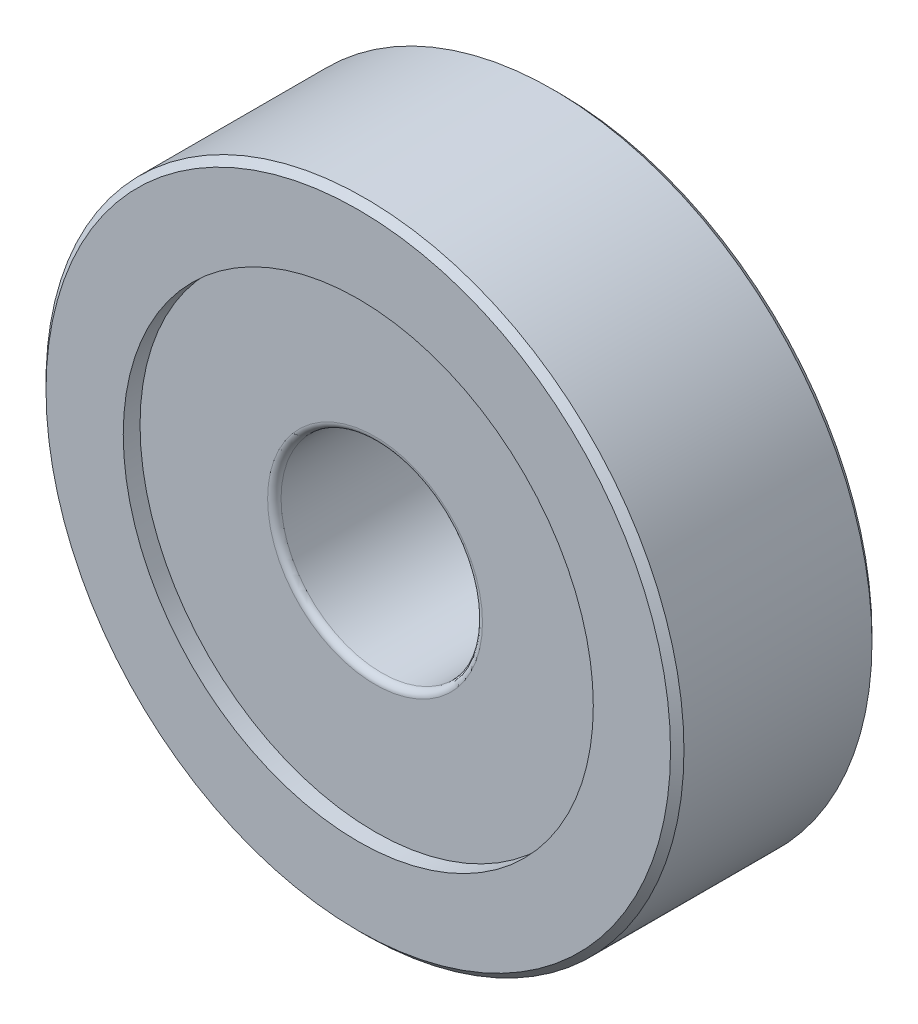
ISO-10303-21;
HEADER;
FILE_DESCRIPTION(('STEP AP214'),'2;1');
FILE_NAME('part.step','',(''),(''),'','','');
FILE_SCHEMA(('AUTOMOTIVE_DESIGN { 1 0 10303 214 1 1 1 1 }'));
ENDSEC;
DATA;
#1=APPLICATION_CONTEXT('core data for automotive mechanical design processes');
#2=APPLICATION_PROTOCOL_DEFINITION('international standard','automotive_design',2000,#1);
#3=PRODUCT_CONTEXT('',#1,'mechanical');
#4=PRODUCT('Part','Part','',(#3));
#5=PRODUCT_RELATED_PRODUCT_CATEGORY('part','',(#4));
#6=PRODUCT_DEFINITION_FORMATION('','',#4);
#7=PRODUCT_DEFINITION_CONTEXT('part definition',#1,'design');
#8=PRODUCT_DEFINITION('design','',#6,#7);
#9=PRODUCT_DEFINITION_SHAPE('','',#8);
#10=(LENGTH_UNIT() NAMED_UNIT(*) SI_UNIT(.MILLI.,.METRE.));
#11=(NAMED_UNIT(*) PLANE_ANGLE_UNIT() SI_UNIT($,.RADIAN.));
#12=(NAMED_UNIT(*) SI_UNIT($,.STERADIAN.) SOLID_ANGLE_UNIT());
#13=UNCERTAINTY_MEASURE_WITH_UNIT(LENGTH_MEASURE(1.E-05),#10,'distance_accuracy_value','');
#14=(GEOMETRIC_REPRESENTATION_CONTEXT(3) GLOBAL_UNCERTAINTY_ASSIGNED_CONTEXT((#13)) GLOBAL_UNIT_ASSIGNED_CONTEXT((#10,
#11,#12)) REPRESENTATION_CONTEXT('',''));
#15=CARTESIAN_POINT('',(0.,0.,0.));
#16=DIRECTION('',(0.,0.,1.));
#17=DIRECTION('',(1.,0.,0.));
#18=AXIS2_PLACEMENT_3D('',#15,#16,#17);
#19=CARTESIAN_POINT('',(0.,0.,2.3));
#20=DIRECTION('',(0.,0.,1.));
#21=DIRECTION('',(1.,0.,0.));
#22=AXIS2_PLACEMENT_3D('',#19,#20,#21);
#23=TOROIDAL_SURFACE('',#22,3.2,0.199999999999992);
#24=CARTESIAN_POINT('',(0.,0.,2.3));
#25=DIRECTION('',(0.,0.,1.));
#26=DIRECTION('',(1.,0.,0.));
#27=AXIS2_PLACEMENT_3D('',#24,#25,#26);
#28=CIRCLE('',#27,3.);
#29=CARTESIAN_POINT('',(3.,0.,2.3));
#30=VERTEX_POINT('',#29);
#31=EDGE_CURVE('E8',#30,#30,#28,.T.);
#32=ORIENTED_EDGE('',*,*,#31,.F.);
#33=EDGE_LOOP('',(#32));
#34=FACE_BOUND('',#33,.T.);
#35=CARTESIAN_POINT('',(0.,0.,2.5));
#36=DIRECTION('',(0.,0.,1.));
#37=DIRECTION('',(1.,0.,0.));
#38=AXIS2_PLACEMENT_3D('',#35,#36,#37);
#39=CIRCLE('',#38,3.2);
#40=CARTESIAN_POINT('',(3.2,0.,2.5));
#41=VERTEX_POINT('',#40);
#42=EDGE_CURVE('E52',#41,#41,#39,.T.);
#43=ORIENTED_EDGE('',*,*,#42,.T.);
#44=EDGE_LOOP('',(#43));
#45=FACE_BOUND('',#44,.T.);
#46=ADVANCED_FACE('F12',(#34,#45),#23,.T.);
#47=CARTESIAN_POINT('',(0.,0.,6.));
#48=DIRECTION('',(0.,0.,1.));
#49=DIRECTION('',(1.,0.,0.));
#50=AXIS2_PLACEMENT_3D('',#47,#48,#49);
#51=CYLINDRICAL_SURFACE('',#50,3.);
#52=CARTESIAN_POINT('',(0.,0.,-2.3));
#53=DIRECTION('',(0.,0.,1.));
#54=DIRECTION('',(1.,0.,0.));
#55=AXIS2_PLACEMENT_3D('',#52,#53,#54);
#56=CIRCLE('',#55,3.);
#57=CARTESIAN_POINT('',(3.,0.,-2.3));
#58=VERTEX_POINT('',#57);
#59=EDGE_CURVE('E18',#58,#58,#56,.T.);
#60=ORIENTED_EDGE('',*,*,#59,.F.);
#61=EDGE_LOOP('',(#60));
#62=FACE_BOUND('',#61,.T.);
#63=ORIENTED_EDGE('',*,*,#31,.T.);
#64=EDGE_LOOP('',(#63));
#65=FACE_BOUND('',#64,.T.);
#66=ADVANCED_FACE('F113',(#62,#65),#51,.F.);
#67=CARTESIAN_POINT('',(0.,0.,-2.3));
#68=DIRECTION('',(0.,0.,1.));
#69=DIRECTION('',(1.,0.,0.));
#70=AXIS2_PLACEMENT_3D('',#67,#68,#69);
#71=TOROIDAL_SURFACE('',#70,3.2,0.199999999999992);
#72=CARTESIAN_POINT('',(0.,0.,-2.5));
#73=DIRECTION('',(0.,0.,1.));
#74=DIRECTION('',(1.,0.,0.));
#75=AXIS2_PLACEMENT_3D('',#72,#73,#74);
#76=CIRCLE('',#75,3.2);
#77=CARTESIAN_POINT('',(3.2,0.,-2.5));
#78=VERTEX_POINT('',#77);
#79=EDGE_CURVE('E22',#78,#78,#76,.T.);
#80=ORIENTED_EDGE('',*,*,#79,.F.);
#81=EDGE_LOOP('',(#80));
#82=FACE_BOUND('',#81,.T.);
#83=ORIENTED_EDGE('',*,*,#59,.T.);
#84=EDGE_LOOP('',(#83));
#85=FACE_BOUND('',#84,.T.);
#86=ADVANCED_FACE('F108',(#82,#85),#71,.T.);
#87=CARTESIAN_POINT('',(0.,3.2,-2.5));
#88=DIRECTION('',(0.,0.,1.));
#89=DIRECTION('',(1.,0.,0.));
#90=AXIS2_PLACEMENT_3D('',#87,#88,#89);
#91=PLANE('',#90);
#92=CARTESIAN_POINT('',(0.,0.,-2.5));
#93=DIRECTION('',(0.,0.,1.));
#94=DIRECTION('',(1.,0.,0.));
#95=AXIS2_PLACEMENT_3D('',#92,#93,#94);
#96=CIRCLE('',#95,7.);
#97=CARTESIAN_POINT('',(7.,0.,-2.5));
#98=VERTEX_POINT('',#97);
#99=EDGE_CURVE('E26',#98,#98,#96,.T.);
#100=ORIENTED_EDGE('',*,*,#99,.F.);
#101=EDGE_LOOP('',(#100));
#102=FACE_BOUND('',#101,.T.);
#103=ORIENTED_EDGE('',*,*,#79,.T.);
#104=EDGE_LOOP('',(#103));
#105=FACE_BOUND('',#104,.T.);
#106=ADVANCED_FACE('F102',(#102,#105),#91,.F.);
#107=CARTESIAN_POINT('',(0.,0.,6.));
#108=DIRECTION('',(0.,0.,1.));
#109=DIRECTION('',(1.,0.,0.));
#110=AXIS2_PLACEMENT_3D('',#107,#108,#109);
#111=CYLINDRICAL_SURFACE('',#110,7.);
#112=CARTESIAN_POINT('',(0.,0.,-3.));
#113=DIRECTION('',(0.,0.,1.));
#114=DIRECTION('',(1.,0.,0.));
#115=AXIS2_PLACEMENT_3D('',#112,#113,#114);
#116=CIRCLE('',#115,7.);
#117=CARTESIAN_POINT('',(7.,0.,-3.));
#118=VERTEX_POINT('',#117);
#119=EDGE_CURVE('E31',#118,#118,#116,.T.);
#120=ORIENTED_EDGE('',*,*,#119,.F.);
#121=EDGE_LOOP('',(#120));
#122=FACE_BOUND('',#121,.T.);
#123=ORIENTED_EDGE('',*,*,#99,.T.);
#124=EDGE_LOOP('',(#123));
#125=FACE_BOUND('',#124,.T.);
#126=ADVANCED_FACE('F96',(#122,#125),#111,.F.);
#127=CARTESIAN_POINT('',(0.,9.3,-3.));
#128=DIRECTION('',(0.,0.,1.));
#129=DIRECTION('',(1.,0.,0.));
#130=AXIS2_PLACEMENT_3D('',#127,#128,#129);
#131=PLANE('',#130);
#132=CARTESIAN_POINT('',(0.,0.,-3.));
#133=DIRECTION('',(0.,0.,1.));
#134=DIRECTION('',(1.,0.,0.));
#135=AXIS2_PLACEMENT_3D('',#132,#133,#134);
#136=CIRCLE('',#135,9.3);
#137=CARTESIAN_POINT('',(9.3,0.,-3.));
#138=VERTEX_POINT('',#137);
#139=EDGE_CURVE('E34',#138,#138,#136,.T.);
#140=ORIENTED_EDGE('',*,*,#139,.F.);
#141=EDGE_LOOP('',(#140));
#142=FACE_BOUND('',#141,.T.);
#143=ORIENTED_EDGE('',*,*,#119,.T.);
#144=EDGE_LOOP('',(#143));
#145=FACE_BOUND('',#144,.T.);
#146=ADVANCED_FACE('F90',(#142,#145),#131,.F.);
#147=CARTESIAN_POINT('',(0.,0.,-3.));
#148=DIRECTION('',(0.,0.,1.));
#149=DIRECTION('',(1.,0.,0.));
#150=AXIS2_PLACEMENT_3D('',#147,#148,#149);
#151=CONICAL_SURFACE('',#150,9.3,0.785398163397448);
#152=CARTESIAN_POINT('',(0.,0.,-2.8));
#153=DIRECTION('',(0.,0.,1.));
#154=DIRECTION('',(1.,0.,0.));
#155=AXIS2_PLACEMENT_3D('',#152,#153,#154);
#156=CIRCLE('',#155,9.5);
#157=CARTESIAN_POINT('',(9.5,0.,-2.8));
#158=VERTEX_POINT('',#157);
#159=EDGE_CURVE('E37',#158,#158,#156,.T.);
#160=ORIENTED_EDGE('',*,*,#159,.F.);
#161=EDGE_LOOP('',(#160));
#162=FACE_BOUND('',#161,.T.);
#163=ORIENTED_EDGE('',*,*,#139,.T.);
#164=EDGE_LOOP('',(#163));
#165=FACE_BOUND('',#164,.T.);
#166=ADVANCED_FACE('F84',(#162,#165),#151,.T.);
#167=CARTESIAN_POINT('',(0.,0.,6.));
#168=DIRECTION('',(0.,0.,1.));
#169=DIRECTION('',(1.,0.,0.));
#170=AXIS2_PLACEMENT_3D('',#167,#168,#169);
#171=CYLINDRICAL_SURFACE('',#170,9.5);
#172=CARTESIAN_POINT('',(0.,0.,2.8));
#173=DIRECTION('',(0.,0.,1.));
#174=DIRECTION('',(1.,0.,0.));
#175=AXIS2_PLACEMENT_3D('',#172,#173,#174);
#176=CIRCLE('',#175,9.5);
#177=CARTESIAN_POINT('',(9.5,0.,2.8));
#178=VERTEX_POINT('',#177);
#179=EDGE_CURVE('E40',#178,#178,#176,.T.);
#180=ORIENTED_EDGE('',*,*,#179,.F.);
#181=EDGE_LOOP('',(#180));
#182=FACE_BOUND('',#181,.T.);
#183=ORIENTED_EDGE('',*,*,#159,.T.);
#184=EDGE_LOOP('',(#183));
#185=FACE_BOUND('',#184,.T.);
#186=ADVANCED_FACE('F78',(#182,#185),#171,.T.);
#187=CARTESIAN_POINT('',(0.,0.,2.8));
#188=DIRECTION('',(0.,0.,-1.));
#189=DIRECTION('',(-1.,0.,0.));
#190=AXIS2_PLACEMENT_3D('',#187,#188,#189);
#191=CONICAL_SURFACE('',#190,9.5,0.785398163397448);
#192=CARTESIAN_POINT('',(0.,0.,3.));
#193=DIRECTION('',(0.,0.,1.));
#194=DIRECTION('',(1.,0.,0.));
#195=AXIS2_PLACEMENT_3D('',#192,#193,#194);
#196=CIRCLE('',#195,9.3);
#197=CARTESIAN_POINT('',(9.3,0.,3.));
#198=VERTEX_POINT('',#197);
#199=EDGE_CURVE('E43',#198,#198,#196,.T.);
#200=ORIENTED_EDGE('',*,*,#199,.F.);
#201=EDGE_LOOP('',(#200));
#202=FACE_BOUND('',#201,.T.);
#203=ORIENTED_EDGE('',*,*,#179,.T.);
#204=EDGE_LOOP('',(#203));
#205=FACE_BOUND('',#204,.T.);
#206=ADVANCED_FACE('F72',(#202,#205),#191,.T.);
#207=CARTESIAN_POINT('',(0.,9.3,3.));
#208=DIRECTION('',(0.,0.,-1.));
#209=DIRECTION('',(-1.,0.,0.));
#210=AXIS2_PLACEMENT_3D('',#207,#208,#209);
#211=PLANE('',#210);
#212=CARTESIAN_POINT('',(0.,0.,3.));
#213=DIRECTION('',(0.,0.,1.));
#214=DIRECTION('',(1.,0.,0.));
#215=AXIS2_PLACEMENT_3D('',#212,#213,#214);
#216=CIRCLE('',#215,7.);
#217=CARTESIAN_POINT('',(7.,0.,3.));
#218=VERTEX_POINT('',#217);
#219=EDGE_CURVE('E46',#218,#218,#216,.T.);
#220=ORIENTED_EDGE('',*,*,#219,.F.);
#221=EDGE_LOOP('',(#220));
#222=FACE_BOUND('',#221,.T.);
#223=ORIENTED_EDGE('',*,*,#199,.T.);
#224=EDGE_LOOP('',(#223));
#225=FACE_BOUND('',#224,.T.);
#226=ADVANCED_FACE('F66',(#222,#225),#211,.F.);
#227=CARTESIAN_POINT('',(0.,0.,6.));
#228=DIRECTION('',(0.,0.,1.));
#229=DIRECTION('',(1.,0.,0.));
#230=AXIS2_PLACEMENT_3D('',#227,#228,#229);
#231=CYLINDRICAL_SURFACE('',#230,7.);
#232=CARTESIAN_POINT('',(0.,0.,2.5));
#233=DIRECTION('',(0.,0.,1.));
#234=DIRECTION('',(1.,0.,0.));
#235=AXIS2_PLACEMENT_3D('',#232,#233,#234);
#236=CIRCLE('',#235,7.);
#237=CARTESIAN_POINT('',(7.,0.,2.5));
#238=VERTEX_POINT('',#237);
#239=EDGE_CURVE('E49',#238,#238,#236,.T.);
#240=ORIENTED_EDGE('',*,*,#239,.F.);
#241=EDGE_LOOP('',(#240));
#242=FACE_BOUND('',#241,.T.);
#243=ORIENTED_EDGE('',*,*,#219,.T.);
#244=EDGE_LOOP('',(#243));
#245=FACE_BOUND('',#244,.T.);
#246=ADVANCED_FACE('F60',(#242,#245),#231,.F.);
#247=CARTESIAN_POINT('',(0.,3.2,2.5));
#248=DIRECTION('',(0.,0.,-1.));
#249=DIRECTION('',(-1.,0.,0.));
#250=AXIS2_PLACEMENT_3D('',#247,#248,#249);
#251=PLANE('',#250);
#252=ORIENTED_EDGE('',*,*,#42,.F.);
#253=EDGE_LOOP('',(#252));
#254=FACE_BOUND('',#253,.T.);
#255=ORIENTED_EDGE('',*,*,#239,.T.);
#256=EDGE_LOOP('',(#255));
#257=FACE_BOUND('',#256,.T.);
#258=ADVANCED_FACE('F57',(#254,#257),#251,.F.);
#259=CLOSED_SHELL('',(#46,#66,#86,#106,#126,#146,#166,#186,#206,#226,#246,#258));
#260=MANIFOLD_SOLID_BREP('B1',#259);
#261=ADVANCED_BREP_SHAPE_REPRESENTATION('',(#18,#260),#14);
#262=SHAPE_DEFINITION_REPRESENTATION(#9,#261);
ENDSEC;
END-ISO-10303-21;
